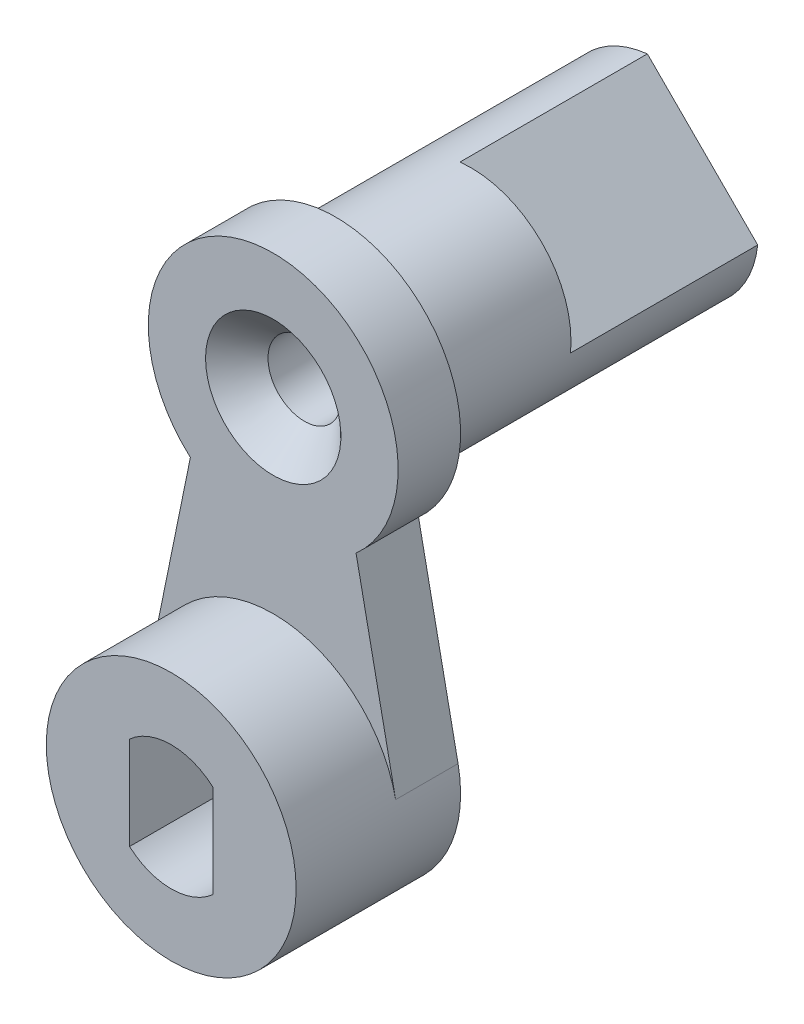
from build123d import *

# Parameters (mm, degrees)
ESQUISSE1_R        = 6
BOSS_EXTRU_1_DEPTH = 7.9
ESQUISSE2_R        = 1.75
BOSS_EXTRU_2_DEPTH = 3
BOSS_EXTRU_3_START = 6.5
ESQUISSE4_R        = 4.8
ESQUISSE4_R_2      = 1.75
BOSS_EXTRU_3_DEPTH = 6.5
BOSS_EXTRU_4_START = 9
ESQUISSE6_R        = 1.75
BOSS_EXTRU_4_DEPTH = 9
CHANFREIN1_SIZE    = 1.5


with BuildPart() as part:
    # Esquisse1 → Boss.-Extru.1 (new body)
    with BuildSketch(Plane.XY):
        Circle(ESQUISSE1_R)
        with BuildLine():
            Line((-2, 2.236067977), (-2, -2.236067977))
            ThreePointArc((-2, -2.236067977), (0, -3), (2, -2.236067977))
            Line((2, -2.236067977), (2, 2.236067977))
            ThreePointArc((2, 2.236067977), (0, 3), (-2, 2.236067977))
        make_face(mode=Mode.SUBTRACT)
    extrude(amount=BOSS_EXTRU_1_DEPTH)

    # Esquisse2 → Boss.-Extru.2 (add)
    with BuildSketch(Plane(origin=(0, 0, 0), x_dir=(-1, 0, 0), z_dir=(0, 0, -1))):
        with BuildLine():
            ThreePointArc((-5.878618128, 1.200770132), (-3.794428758, 4.647828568), (0, 6))
            ThreePointArc((0, 6), (3.794428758, 4.647828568), (5.878618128, 1.200770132))
            Line((5.878618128, 1.200770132), (3.97861816, 10.508831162))
            ThreePointArc((3.97861816, 10.508831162), (0, 21), (-3.97861816, 10.508831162))
            Line((-3.97861816, 10.508831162), (-5.878618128, 1.200770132))
        make_face()
        with Locations((0, 15)):
            Circle(ESQUISSE2_R, mode=Mode.SUBTRACT)
    extrude(amount=-BOSS_EXTRU_2_DEPTH)

    # Esquisse4 → Boss.-Extru.3 (add)
    with BuildSketch(Plane(origin=(0, 0, 0), x_dir=(-1, 0, 0), z_dir=(0, 0, -1)).offset(BOSS_EXTRU_3_START)):
        with Locations(Location((0, 15, 0), (0, 0, 180))):
            Circle(ESQUISSE4_R)
        with Locations((0, 15)):
            Circle(ESQUISSE4_R_2, mode=Mode.SUBTRACT)
    extrude(amount=-BOSS_EXTRU_3_DEPTH)

    # Esquisse6 → Boss.-Extru.4 (add)
    with BuildSketch(Plane(origin=(0, 0, -6.5), x_dir=(-1, 0, 0), z_dir=(0, 0, -1)).offset(BOSS_EXTRU_4_START)):
        with BuildLine():
            ThreePointArc((-4.770848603, 14.471792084), (-3.39411255, 11.60588745), (-0.528207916, 10.229151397))
            Line((-0.528207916, 10.229151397), (4.770848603, 15.528207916))
            ThreePointArc((4.770848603, 15.528207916), (3.39411255, 18.39411255), (0.528207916, 19.770848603))
            Line((0.528207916, 19.770848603), (-4.770848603, 14.471792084))
        make_face()
        with Locations((0, 15)):
            Circle(ESQUISSE6_R, mode=Mode.SUBTRACT)
    extrude(amount=-BOSS_EXTRU_4_DEPTH)

    # Chanfrein1
    chanfrein1_edges = [part.edges().sort_by_distance(p)[0] for p in [
        (1.75, 15, 3),
    ]]
    chamfer(chanfrein1_edges, length=CHANFREIN1_SIZE)


solid = part.part
